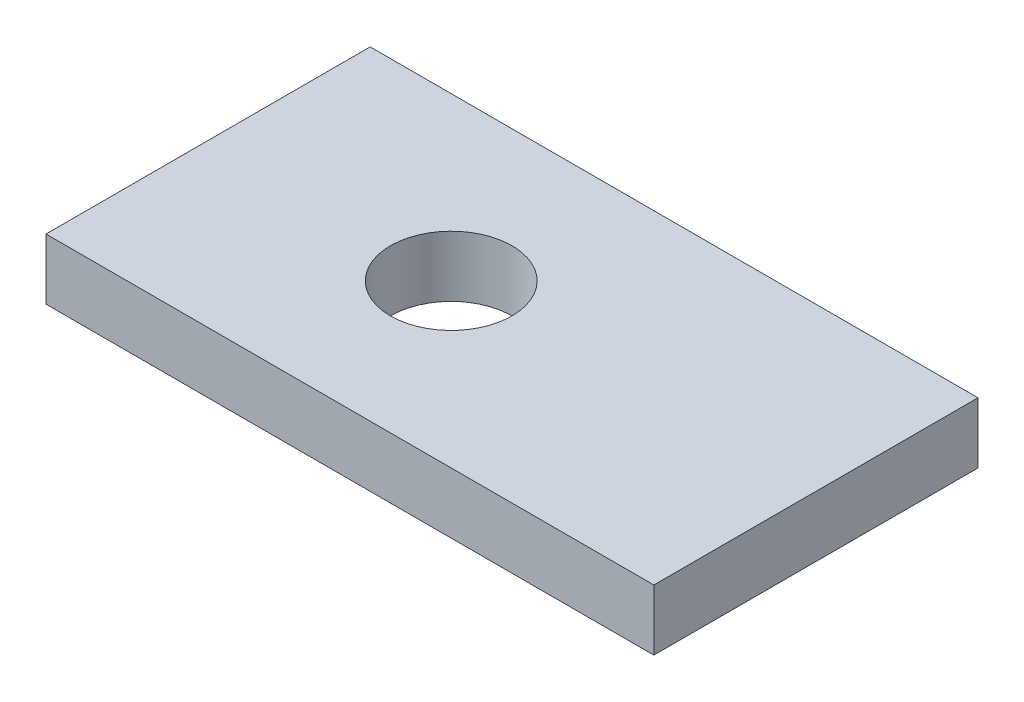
from build123d import *

# Parameters (mm, degrees)
BASESKETCH_W   = 150
BASESKETCH_H   = 80
BASEBOSS_DEPTH = 15
HOLESKETCH_R   = 15
HOLECUT_DEPTH  = 15


with BuildPart() as part:
    # BaseSketch → BaseBoss (new body)
    with BuildSketch(Plane(origin=(0, 0, 0), x_dir=(1, 0, 0), z_dir=(0, 1, 0))):
        with Locations((75, 40)):
            Rectangle(BASESKETCH_W, BASESKETCH_H)
    extrude(amount=-BASEBOSS_DEPTH)

    # HoleSketch → HoleCut (cut)
    with BuildSketch(Plane(origin=(0, 0, 0), x_dir=(1, 0, 0), z_dir=(0, 1, 0))):
        with Locations(Location((60, 40, 0), (0, 0, 270))):
            Circle(HOLESKETCH_R)
    extrude(amount=-HOLECUT_DEPTH, mode=Mode.SUBTRACT)


solid = part.part
